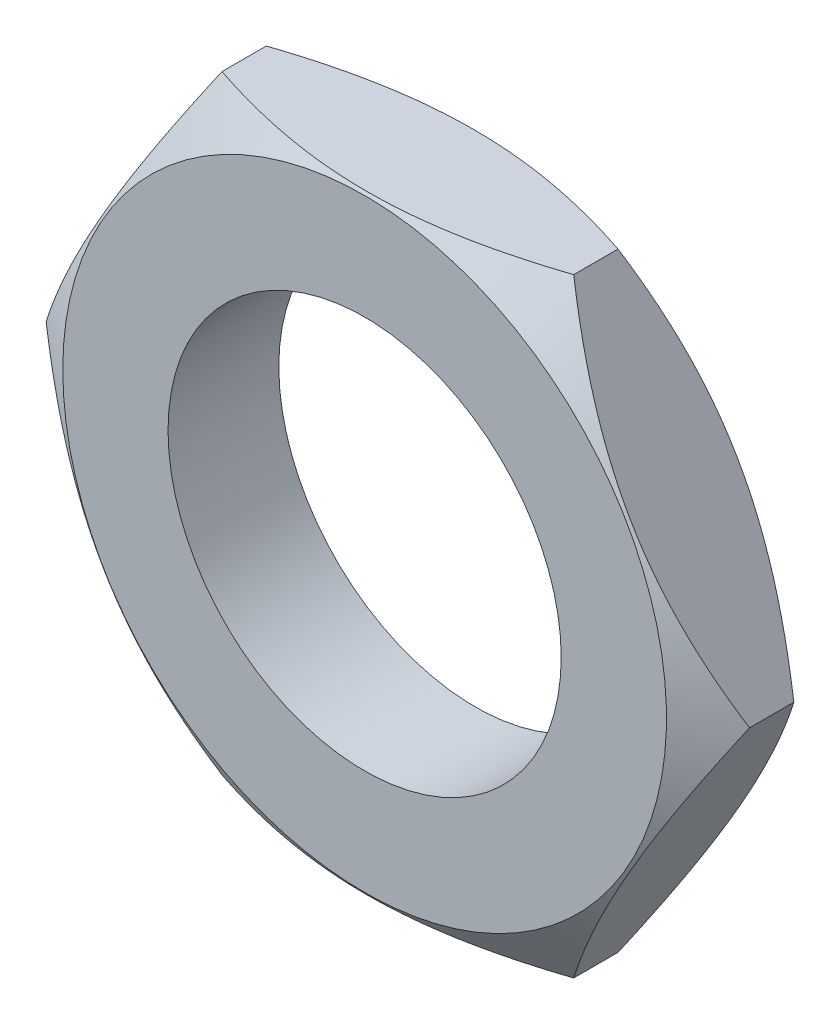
from build123d import *

# Parameters (mm, degrees)
ESQUISSE1_R        = 3.55
BOSS_EXTRU_1_DEPTH = 1


with BuildPart() as part:
    # Esquisse1 → Boss.-Extru.1 (new, symmetric)
    with BuildSketch(Plane.XY):
        Polygon((3.175426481, -5.5), (6.350852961, 0), (3.175426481, 5.5), (-3.175426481, 5.5), (-6.350852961, 0), (-3.175426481, -5.5), align=None)
        Circle(ESQUISSE1_R, mode=Mode.SUBTRACT)
    extrude(amount=BOSS_EXTRU_1_DEPTH, both=True)

    # Esquisse2 → Enl_vement de mati_re-R_volution1 (revolve, cut)
    with BuildSketch(Plane(origin=(0, 0, 0), x_dir=(1, 0, 0), z_dir=(0, 1, 0))):
        Polygon((-6.350852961, -0.4), (-5.450852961, -1), (-6.350852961, -1), align=None)
    enl_vement_de_mati_re_r_volution1 = revolve(axis=Axis((0, 0, -0.1), (0, 0, 1)), mode=Mode.SUBTRACT)

    # Sym_trie2: Enl_vement de mati_re-R_volution1 across plane
    add(enl_vement_de_mati_re_r_volution1.mirror(Plane.XY), mode=Mode.SUBTRACT)


solid = part.part
